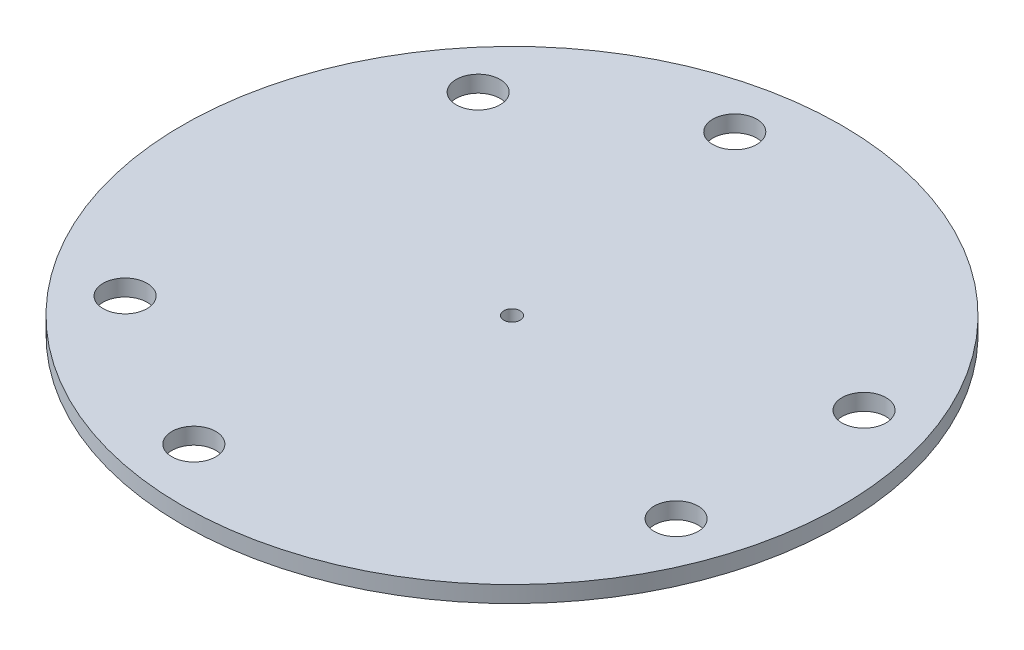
from build123d import *

# Parameters (mm, degrees)
SKETCH_1_W               = 600
SKETCH_1_H               = 30
SKETCH_2_R               = 40
CUT_EXTRUDE_1_DEPTH      = 850.058301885
PATTERN_CIRCULAR_1_COUNT = 3
SKETCH_3_R               = 40
CUT_EXTRUDE_2_DEPTH      = 850.058301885
PATTERN_CIRCULAR_2_COUNT = 3
SKETCH_4_R               = 15
CUT_EXTRUDE_3_DEPTH      = 850.058301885


with BuildPart() as part:
    # Sketch 1 → Revolve 1 (revolve)
    with BuildSketch(Plane.XY, mode=Mode.PRIVATE) as revolve_1_sk:
        with Locations((300, 15)):
            Rectangle(SKETCH_1_W, SKETCH_1_H)
    revolve(revolve_1_sk.sketch.rotate(Axis((0, -34.978212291, 0), (0, 1, 0)), 90), axis=Axis((0, -34.978212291, 0), (0, 1, 0)))

    # Sketch 2 → Cut-Extrude 1 (cut, through all)
    with BuildSketch(Plane(origin=(0, 30, 0), x_dir=(1, 0, 0), z_dir=(0, 1, 0))):
        with Locations(Location((469.846310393, 171.010071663, 0), (0, 0, 270))):
            Circle(SKETCH_2_R)
    cut_extrude_1 = extrude(amount=-CUT_EXTRUDE_1_DEPTH, mode=Mode.SUBTRACT)

    # Pattern Circular 1: Cut-Extrude 1 ×3 about axis
    pattern_circular_1_axis = Axis((0, 0, 0), (0, 1, 0))
    for i in range(1, PATTERN_CIRCULAR_1_COUNT):
        add(cut_extrude_1.rotate(pattern_circular_1_axis, i * 360 / PATTERN_CIRCULAR_1_COUNT), mode=Mode.SUBTRACT)

    # Sketch 3 → Cut-Extrude 2 (cut, through all)
    with BuildSketch(Plane(origin=(0, 30, 0), x_dir=(1, 0, 0), z_dir=(0, 1, 0))):
        with Locations(Location((-86.824088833, 492.403876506, 0), (0, 0, 270))):
            Circle(SKETCH_3_R)
    cut_extrude_2 = extrude(amount=-CUT_EXTRUDE_2_DEPTH, mode=Mode.SUBTRACT)

    # Pattern Circular 2: Cut-Extrude 2 ×3 about axis
    pattern_circular_2_axis = Axis((0, 0, 0), (0, 1, 0))
    for i in range(1, PATTERN_CIRCULAR_2_COUNT):
        add(cut_extrude_2.rotate(pattern_circular_2_axis, i * 360 / PATTERN_CIRCULAR_2_COUNT), mode=Mode.SUBTRACT)

    # Sketch 4 → Cut-Extrude 3 (cut, through all)
    with BuildSketch(Plane(origin=(0, 30, 0), x_dir=(1, 0, 0), z_dir=(0, 1, 0))):
        with Locations(Location((0, 0, 0), (0, 0, 270))):
            Circle(SKETCH_4_R)
    extrude(amount=-CUT_EXTRUDE_3_DEPTH, mode=Mode.SUBTRACT)


solid = part.part
